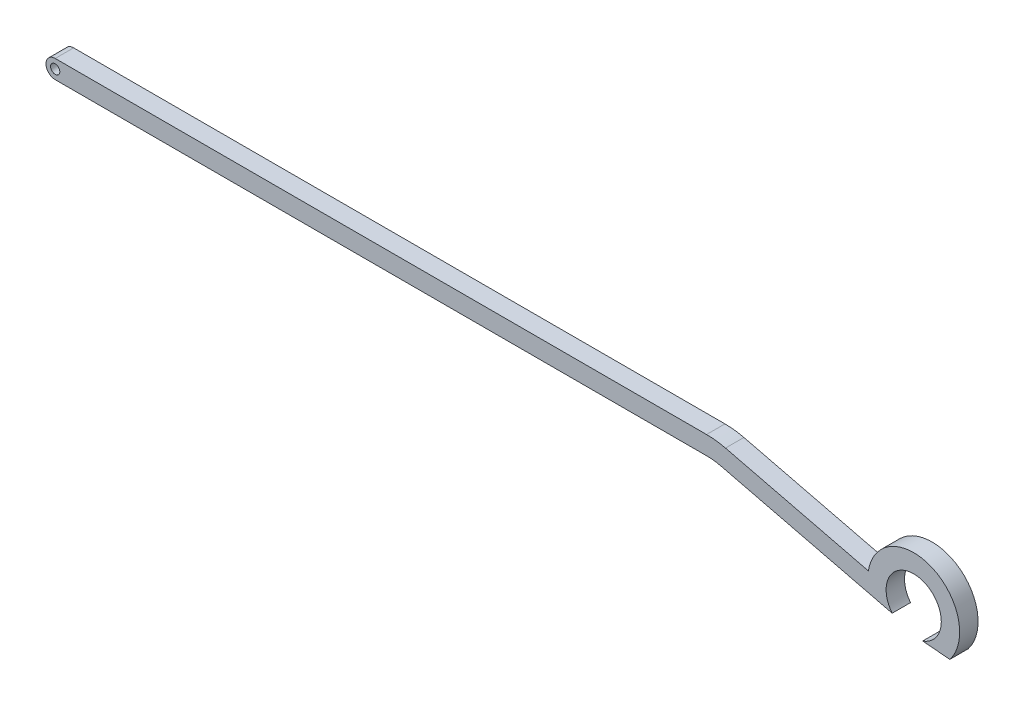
from build123d import *

# Parameters (mm, degrees)
EXTRUSION1_DEPTH        = 6
ESQUISSE2_R             = 1.5
ENL_V_MAT_EXTRU_1_DEPTH = 6


with BuildPart() as part:
    # Esquisse1 → Extrusion1 (new body)
    with BuildSketch(Plane.XY):
        with BuildLine():
            Line((130.718809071, 9.349065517), (139.573139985, 8.575485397))
            ThreePointArc((139.573139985, 8.575485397), (133.846986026, 31.583241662), (112.992182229, 20.30393113))
            Line((112.992182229, 20.30393113), (66.405984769, 31.691668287))
            ThreePointArc((66.405984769, 31.691668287), (63.341406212, 32.248718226), (60.232204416, 32.435294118))
            Line((60.232204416, 32.435294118), (-152.208288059, 32.435294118))
            ThreePointArc((-152.208288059, 32.435294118), (-155.208288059, 29.435294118), (-152.208288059, 26.435294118))
            Line((-152.208288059, 26.435294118), (60.232204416, 26.435294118))
            ThreePointArc((60.232204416, 26.435294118), (62.623898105, 26.291774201), (64.981266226, 25.863274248))
            Line((64.981266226, 25.863274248), (120.773854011, 12.225086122))
            ThreePointArc((120.773854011, 12.225086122), (130.292002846, 26.505494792), (130.718809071, 9.349065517))
        make_face()
    extrude(amount=EXTRUSION1_DEPTH)

    # Esquisse2 → Enl_v. mat.-Extru.1 (cut)
    with BuildSketch(Plane.XY.offset(6)):
        with Locations((-152.208288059, 29.435294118)):
            Circle(ESQUISSE2_R)
    extrude(amount=-ENL_V_MAT_EXTRU_1_DEPTH, mode=Mode.SUBTRACT)


solid = part.part
